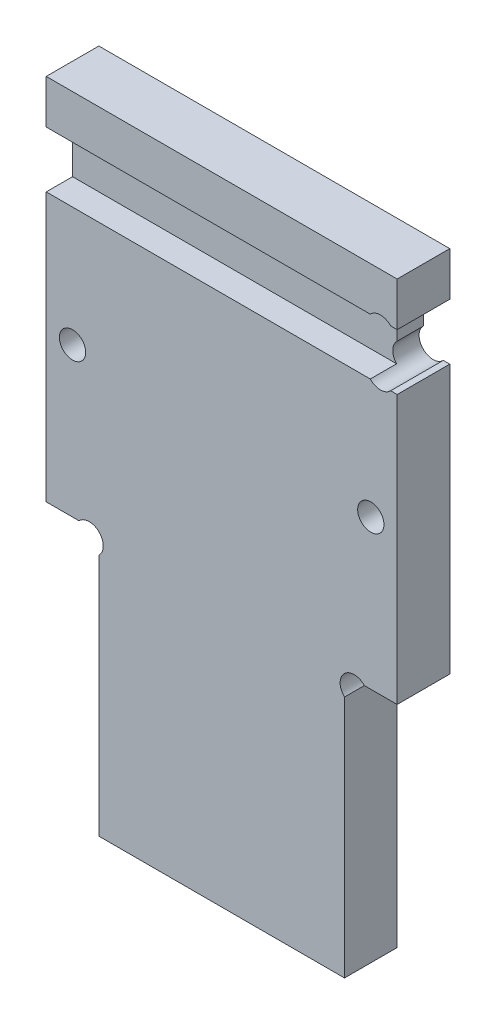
from build123d import *

# Parameters (mm, degrees)
ESQUISSE1_W             = 40
ESQUISSE1_H             = 72
BASE_EXTRUSION_DEPTH    = 6
ESQUISSE2_W             = 40
ESQUISSE2_H             = 6.4
ENL_V_MAT_EXTRU_1_DEPTH = 3
ENL_V_START             = -6
ESQUISSE3_R             = 1.5
ENL_V_MAT_EXTRU_2_DEPTH = 6
ESQUISSE4_W             = 6
ESQUISSE4_H             = 30
ENL_V_MAT_EXTRU_3_DEPTH = 6
ESQUISSE6_W             = 3
ESQUISSE6_H             = 6.4
ENL_V_MAT_EXTRU_5_DEPTH = 3
ESQUISSE5_R             = 1.6
ENL_V_MAT_EXTRU_4_DEPTH = 6


with BuildPart() as part:
    # Esquisse1 → Base-Extrusion (new body)
    with BuildSketch(Plane.XY):
        with Locations((-13.342296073, 11.973514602)):
            Rectangle(ESQUISSE1_W, ESQUISSE1_H)
    extrude(amount=BASE_EXTRUSION_DEPTH)

    # Esquisse2 → Enl_v. mat.-Extru.1 (cut)
    with BuildSketch(Plane.XY.offset(6)):
        with Locations((-13.342296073, 39.773514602)):
            Rectangle(ESQUISSE2_W, ESQUISSE2_H)
    extrude(amount=-ENL_V_MAT_EXTRU_1_DEPTH, mode=Mode.SUBTRACT)

    # Esquisse3 → Enl_v. mat.-Extru.2 (cut)
    with BuildSketch(Plane.XY.offset(6).offset(ENL_V_START)):
        with Locations((3.657703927, 22.973514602)):
            Circle(ESQUISSE3_R)
        with Locations((-30.342296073, 22.973514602)):
            Circle(ESQUISSE3_R)
    extrude(amount=ENL_V_MAT_EXTRU_2_DEPTH, mode=Mode.SUBTRACT)

    # Esquisse4 → Enl_v. mat.-Extru.3 (cut)
    with BuildSketch(Plane.XY.offset(6).offset(ENL_V_START)):
        with Locations((-30.342296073, -9.026485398)):
            Rectangle(ESQUISSE4_W, ESQUISSE4_H)
        with Locations((3.657703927, -9.026485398)):
            Rectangle(ESQUISSE4_W, ESQUISSE4_H)
    extrude(amount=ENL_V_MAT_EXTRU_3_DEPTH, mode=Mode.SUBTRACT)

    # Esquisse6 → Enl_v. mat.-Extru.5 (cut)
    with BuildSketch(Plane.XY.offset(3)):
        with Locations((5.157703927, 39.773514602)):
            Rectangle(ESQUISSE6_W, ESQUISSE6_H)
    extrude(amount=-ENL_V_MAT_EXTRU_5_DEPTH, mode=Mode.SUBTRACT)

    # Esquisse5 → Enl_v. mat.-Extru.4 (cut)
    with BuildSketch(Plane.XY.offset(6).offset(ENL_V_START)):
        with Locations((-28.442296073, 4.873514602)):
            Circle(ESQUISSE5_R)
        with Locations((1.757703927, 4.873514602)):
            Circle(ESQUISSE5_R)
        with Locations((4.757703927, 41.873514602)):
            Circle(ESQUISSE5_R)
        with Locations((4.757703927, 37.673514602)):
            Circle(ESQUISSE5_R)
    extrude(amount=ENL_V_MAT_EXTRU_4_DEPTH, mode=Mode.SUBTRACT)


solid = part.part
